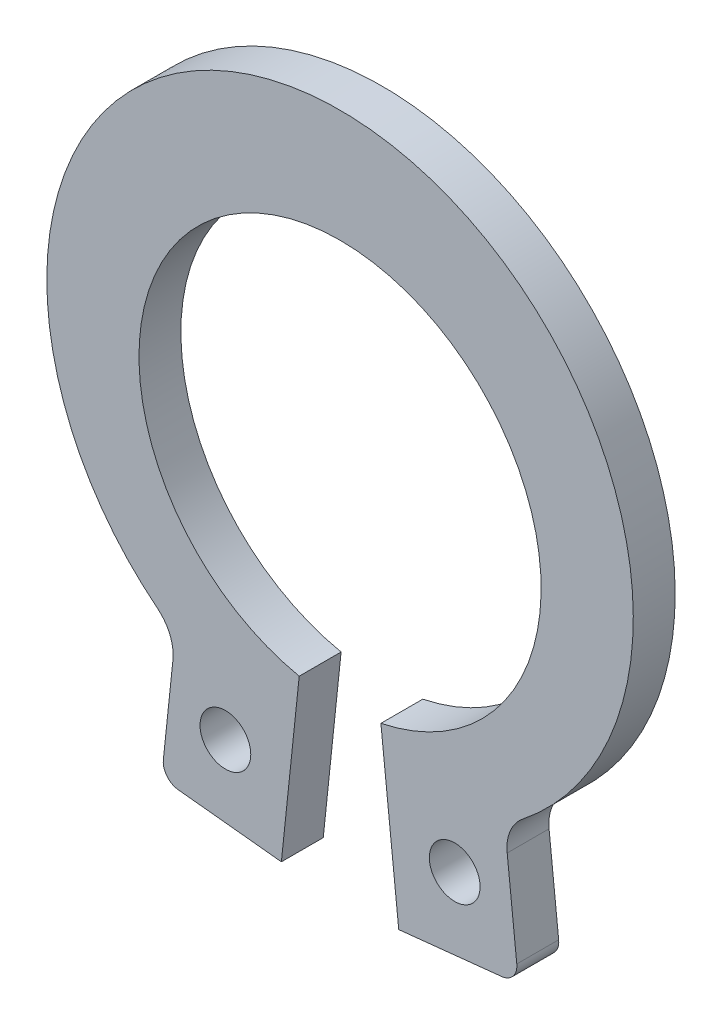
from build123d import *

# Parameters (mm, degrees)
BASE_EXTRUSION_DEPTH    = 1
ENL_V_MAT_EXTRU_1_DEPTH = 1


with BuildPart() as part:
    # Esquisse1 → Base-Extrusion (new body)
    with BuildSketch(Plane.XY):
        with BuildLine():
            Line((-1.400751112, -8.751279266), (-0.974938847, -4.699946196))
            ThreePointArc((-0.974938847, -4.699946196), (0, 4.8), (0.974938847, -4.699946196))
            Line((0.974938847, -4.699946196), (1.400751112, -8.751279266))
            Line((1.400751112, -8.751279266), (3.862714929, -8.492516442))
            ThreePointArc((3.862714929, -8.492516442), (4.131761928, -8.34643584), (4.218712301, -8.052896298))
            Line((4.218712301, -8.052896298), (3.989583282, -5.872879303))
            ThreePointArc((3.989583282, -5.872879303), (4.061781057, -5.381933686), (4.36109203, -4.986139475))
            ThreePointArc((4.36109203, -4.986139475), (0, 7.489340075), (-4.36109203, -4.986139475))
            ThreePointArc((-4.36109203, -4.986139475), (-4.061781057, -5.381933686), (-3.989583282, -5.872879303))
            Line((-3.989583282, -5.872879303), (-4.218712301, -8.052896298))
            ThreePointArc((-4.218712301, -8.052896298), (-4.131761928, -8.34643584), (-3.862714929, -8.492516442))
            Line((-3.862714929, -8.492516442), (-1.400751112, -8.751279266))
        make_face()
    extrude(amount=BASE_EXTRUSION_DEPTH)

    # Esquisse2 → Enl_v. mat.-Extru.1 (cut)
    with BuildSketch(Plane.XY):
        with BuildLine():
            ThreePointArc((2.542369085, -6.322629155), (3.342273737, -6.921991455), (2.494546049, -7.451557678))
            ThreePointArc((2.494546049, -7.451557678), (2.131696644, -6.870709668), (2.542369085, -6.322629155))
        make_face()
        with BuildLine():
            ThreePointArc((-2.494546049, -7.451557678), (-2.131696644, -6.870709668), (-2.542369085, -6.322629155))
            ThreePointArc((-2.542369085, -6.322629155), (-3.342273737, -6.921991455), (-2.494546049, -7.451557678))
        make_face()
    extrude(amount=ENL_V_MAT_EXTRU_1_DEPTH, mode=Mode.SUBTRACT)


solid = part.part
